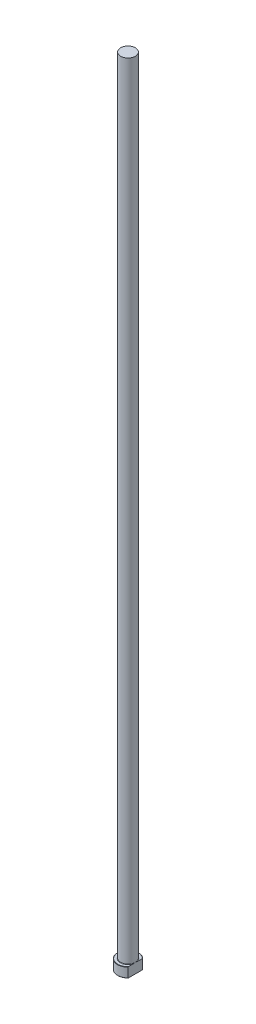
from build123d import *
from build123d.topology import SkipClean

# Parameters (mm, degrees)
CHAMFER1_SIZE    = 0.2
FILLET1_R        = 0.3
KEYED_HEAD_DEPTH = 651.111144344


with BuildPart() as part:
    # Sketch1 → Revolve1 (revolve)
    with BuildSketch(Plane.XY, mode=Mode.PRIVATE) as revolve1_sk:
        Polygon((0, 0), (-8.5, 0), (-8.5, 8), (-6, 8), (-6, 650), (0, 650), align=None)
    revolve(revolve1_sk.sketch.rotate(Axis((0, 259.958771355, 0), (0, -1, 0)), 270), axis=Axis((0, 259.958771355, 0), (0, -1, 0)))

    # Chamfer1
    chamfer1_edges = [part.edges().sort_by_distance(p)[0] for p in [
        (0, 8, -8.5),
        (0, 0, -8.5),
    ]]
    chamfer(chamfer1_edges, length=CHAMFER1_SIZE)

    # Fillet1
    fillet1_edges = [part.edges().sort_by_distance(p)[0] for p in [
        (0, 8, -6),
    ]]
    fillet(fillet1_edges, radius=FILLET1_R)

    # Sketch2 → KEYED HEAD (cut, through all)
    with SkipClean():  # the faces are left unmerged after this step: merging them gives an invalid solid
        with BuildSketch(Plane(origin=(0, 0, 0), x_dir=(1, 0, 0), z_dir=(0, 1, 0))):
            with BuildLine():
                Line((6, -6.020797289), (6, 6.020797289))
                ThreePointArc((6, 6.020797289), (8.5, 0), (6, -6.020797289))
            make_face()
        extrude(amount=KEYED_HEAD_DEPTH, mode=Mode.SUBTRACT)


solid = part.part
